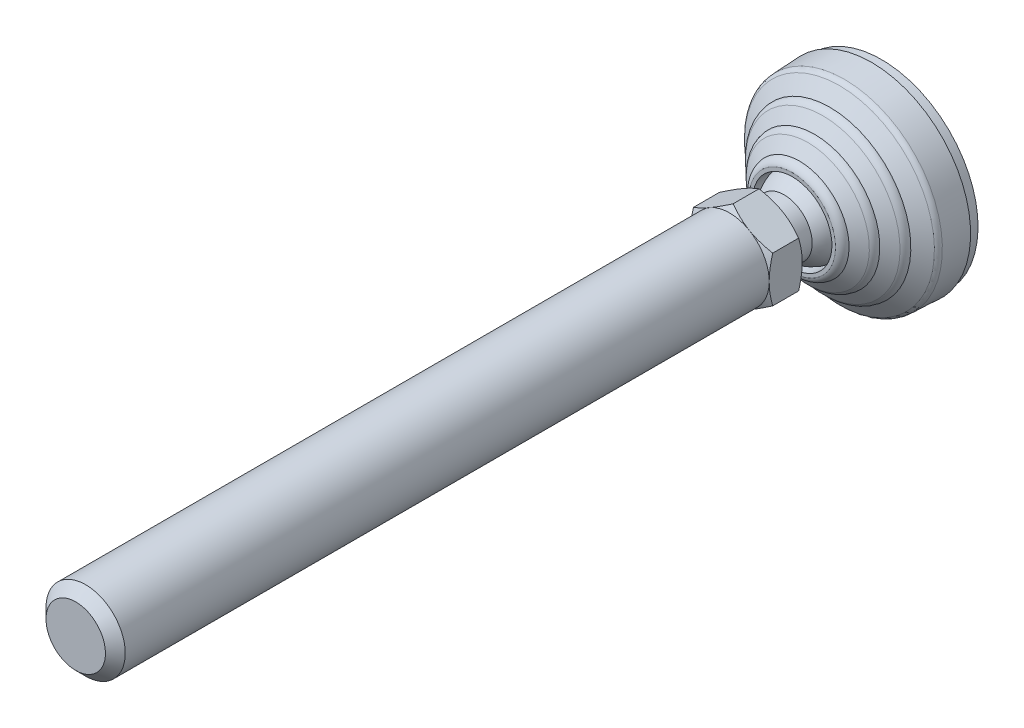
ISO-10303-21;
HEADER;
FILE_DESCRIPTION(('STEP AP214'),'2;1');
FILE_NAME('part.step','',(''),(''),'','','');
FILE_SCHEMA(('AUTOMOTIVE_DESIGN { 1 0 10303 214 1 1 1 1 }'));
ENDSEC;
DATA;
#1=APPLICATION_CONTEXT('core data for automotive mechanical design processes');
#2=APPLICATION_PROTOCOL_DEFINITION('international standard','automotive_design',2000,#1);
#3=PRODUCT_CONTEXT('',#1,'mechanical');
#4=PRODUCT('Part','Part','',(#3));
#5=PRODUCT_RELATED_PRODUCT_CATEGORY('part','',(#4));
#6=PRODUCT_DEFINITION_FORMATION('','',#4);
#7=PRODUCT_DEFINITION_CONTEXT('part definition',#1,'design');
#8=PRODUCT_DEFINITION('design','',#6,#7);
#9=PRODUCT_DEFINITION_SHAPE('','',#8);
#10=(LENGTH_UNIT() NAMED_UNIT(*) SI_UNIT(.MILLI.,.METRE.));
#11=(NAMED_UNIT(*) PLANE_ANGLE_UNIT() SI_UNIT($,.RADIAN.));
#12=(NAMED_UNIT(*) SI_UNIT($,.STERADIAN.) SOLID_ANGLE_UNIT());
#13=UNCERTAINTY_MEASURE_WITH_UNIT(LENGTH_MEASURE(1.E-05),#10,'distance_accuracy_value','');
#14=(GEOMETRIC_REPRESENTATION_CONTEXT(3) GLOBAL_UNCERTAINTY_ASSIGNED_CONTEXT((#13)) GLOBAL_UNIT_ASSIGNED_CONTEXT((#10,
#11,#12)) REPRESENTATION_CONTEXT('',''));
#15=CARTESIAN_POINT('',(0.,0.,0.));
#16=DIRECTION('',(0.,0.,1.));
#17=DIRECTION('',(1.,0.,0.));
#18=AXIS2_PLACEMENT_3D('',#15,#16,#17);
#19=CARTESIAN_POINT('',(0.,0.,93.1595));
#20=DIRECTION('',(0.,0.,-1.));
#21=DIRECTION('',(0.,1.,0.));
#22=AXIS2_PLACEMENT_3D('',#19,#20,#21);
#23=CYLINDRICAL_SURFACE('',#22,12.);
#24=CARTESIAN_POINT('',(0.,0.,241.));
#25=DIRECTION('',(0.,0.,1.));
#26=DIRECTION('',(0.,-1.,0.));
#27=AXIS2_PLACEMENT_3D('',#24,#25,#26);
#28=CIRCLE('',#27,12.);
#29=CARTESIAN_POINT('',(0.,-12.,241.));
#30=VERTEX_POINT('',#29);
#31=EDGE_CURVE('E9',#30,#30,#28,.F.);
#32=ORIENTED_EDGE('',*,*,#31,.T.);
#33=EDGE_LOOP('',(#32));
#34=FACE_BOUND('',#33,.T.);
#35=CARTESIAN_POINT('',(0.,0.,46.));
#36=DIRECTION('',(0.,0.,-1.));
#37=DIRECTION('',(0.,1.,0.));
#38=AXIS2_PLACEMENT_3D('',#35,#36,#37);
#39=CIRCLE('',#38,12.);
#40=CARTESIAN_POINT('',(0.,12.,46.));
#41=VERTEX_POINT('',#40);
#42=EDGE_CURVE('E124',#41,#41,#39,.F.);
#43=ORIENTED_EDGE('',*,*,#42,.T.);
#44=EDGE_LOOP('',(#43));
#45=FACE_BOUND('',#44,.T.);
#46=ADVANCED_FACE('F14',(#34,#45),#23,.T.);
#47=CARTESIAN_POINT('',(11.995,0.,46.));
#48=DIRECTION('',(0.,0.,-1.));
#49=DIRECTION('',(0.,1.,0.));
#50=AXIS2_PLACEMENT_3D('',#47,#48,#49);
#51=PLANE('',#50);
#52=CARTESIAN_POINT('',(0.,0.,46.));
#53=DIRECTION('',(0.,0.,-1.));
#54=DIRECTION('',(0.,1.,0.));
#55=AXIS2_PLACEMENT_3D('',#52,#53,#54);
#56=CIRCLE('',#55,11.99);
#57=CARTESIAN_POINT('',(0.,11.99,46.));
#58=VERTEX_POINT('',#57);
#59=EDGE_CURVE('E132',#58,#58,#56,.F.);
#60=ORIENTED_EDGE('',*,*,#59,.T.);
#61=EDGE_LOOP('',(#60));
#62=FACE_BOUND('',#61,.T.);
#63=ORIENTED_EDGE('',*,*,#42,.F.);
#64=EDGE_LOOP('',(#63));
#65=FACE_BOUND('',#64,.T.);
#66=ADVANCED_FACE('F157',(#62,#65),#51,.T.);
#67=CARTESIAN_POINT('',(0.,0.,44.9159643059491));
#68=DIRECTION('',(0.,0.,-1.));
#69=DIRECTION('',(0.,1.,0.));
#70=AXIS2_PLACEMENT_3D('',#67,#68,#69);
#71=CONICAL_SURFACE('',#70,13.8676048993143,1.0471975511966);
#72=ORIENTED_EDGE('',*,*,#59,.F.);
#73=EDGE_LOOP('',(#72));
#74=FACE_BOUND('',#73,.T.);
#75=CARTESIAN_POINT('',(-2.88482840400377E-08,-13.8564064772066,44.9224297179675));
#76=CARTESIAN_POINT('',(0.263784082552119,-13.7041106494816,45.010340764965));
#77=CARTESIAN_POINT('',(0.528551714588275,-13.5512469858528,45.0942615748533));
#78=CARTESIAN_POINT('',(1.06021019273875,-13.2442938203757,45.2530155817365));
#79=CARTESIAN_POINT('',(1.32710170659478,-13.0902039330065,45.3278457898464));
#80=CARTESIAN_POINT('',(2.13207647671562,-12.6254515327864,45.537252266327));
#81=CARTESIAN_POINT('',(2.67333741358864,-12.3129543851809,45.6563603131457));
#82=CARTESIAN_POINT('',(3.48330954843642,-11.8453167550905,45.796023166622));
#83=CARTESIAN_POINT('',(3.74960108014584,-11.6915732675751,45.8358073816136));
#84=CARTESIAN_POINT('',(4.28341699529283,-11.3833745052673,45.9025217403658));
#85=CARTESIAN_POINT('',(4.55094140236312,-11.2289192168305,45.9294516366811));
#86=CARTESIAN_POINT('',(5.08643614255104,-10.9197511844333,45.9697675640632));
#87=CARTESIAN_POINT('',(5.35440556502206,-10.7650389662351,45.9831696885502));
#88=CARTESIAN_POINT('',(5.8905925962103,-10.4554712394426,45.996144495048));
#89=CARTESIAN_POINT('',(6.15881019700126,-10.3006157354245,45.9957176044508));
#90=CARTESIAN_POINT('',(6.66023029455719,-10.0111207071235,45.9820002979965));
#91=CARTESIAN_POINT('',(6.89346857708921,-9.87646052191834,45.97038309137));
#92=CARTESIAN_POINT('',(7.35940867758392,-9.60744987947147,45.9369099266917));
#93=CARTESIAN_POINT('',(7.59211045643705,-9.47309944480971,45.9150532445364));
#94=CARTESIAN_POINT('',(8.05685109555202,-9.20478131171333,45.8614821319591));
#95=CARTESIAN_POINT('',(8.28888924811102,-9.07081402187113,45.8297595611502));
#96=CARTESIAN_POINT('',(8.75187776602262,-8.80350747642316,45.7570131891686));
#97=CARTESIAN_POINT('',(8.98282805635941,-8.67016826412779,45.7159887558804));
#98=CARTESIAN_POINT('',(9.68388987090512,-8.26541003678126,45.5779256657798));
#99=CARTESIAN_POINT('',(10.1519713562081,-7.99516306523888,45.4671213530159));
#100=CARTESIAN_POINT('',(11.081155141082,-7.45869855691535,45.2156417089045));
#101=CARTESIAN_POINT('',(11.5422693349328,-7.19247415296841,45.075025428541));
#102=CARTESIAN_POINT('',(11.9999999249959,-6.92820327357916,44.922429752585));
#103=B_SPLINE_CURVE_WITH_KNOTS('',3,(#75,#76,#77,#78,#79,#80,#81,#82,#83,#84,#85,#86,#87,#88,
#89,#90,#91,#92,#93,#94,#95,#96,#97,#98,#99,#100,#101,#102),.UNSPECIFIED.,.F.,.F.,(4,2,2,2,2,2,
2,2,2,2,2,2,2,4),(0.,0.950996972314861,1.90230578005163,3.80897261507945,4.73890631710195,
5.6688579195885,6.59770188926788,7.52651715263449,8.33503482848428,9.14360968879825,
9.95285348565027,10.7621522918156,12.4163368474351,14.0672749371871),.UNSPECIFIED.);
#104=CARTESIAN_POINT('',(-1.44241383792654E-08,-13.8564064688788,44.9224297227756));
#105=VERTEX_POINT('',#104);
#106=CARTESIAN_POINT('',(12.,-6.92820324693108,44.9224297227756));
#107=VERTEX_POINT('',#106);
#108=EDGE_CURVE('E143',#105,#107,#103,.T.);
#109=ORIENTED_EDGE('',*,*,#108,.T.);
#110=CARTESIAN_POINT('',(12.,-6.92820326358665,44.9224297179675));
#111=CARTESIAN_POINT('',(12.,-6.64374493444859,45.0045333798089));
#112=CARTESIAN_POINT('',(12.,-6.35829458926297,45.0831531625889));
#113=CARTESIAN_POINT('',(12.,-5.78524260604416,45.2325348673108));
#114=CARTESIAN_POINT('',(12.,-5.49764024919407,45.3032940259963));
#115=CARTESIAN_POINT('',(12.,-4.63053083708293,45.5026195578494));
#116=CARTESIAN_POINT('',(12.,-4.04782834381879,45.6179071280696));
#117=CARTESIAN_POINT('',(12.,-3.17548925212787,45.7575170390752));
#118=CARTESIAN_POINT('',(12.,-2.88840964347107,45.7982045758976));
#119=CARTESIAN_POINT('',(12.,-2.31290718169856,45.8685767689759));
#120=CARTESIAN_POINT('',(12.,-2.02448443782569,45.8982623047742));
#121=CARTESIAN_POINT('',(12.,-1.44696804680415,45.9459902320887));
#122=CARTESIAN_POINT('',(12.,-1.15787537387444,45.9640443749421));
#123=CARTESIAN_POINT('',(12.,-0.579188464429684,45.9881624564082));
#124=CARTESIAN_POINT('',(12.,-0.289594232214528,45.994226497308));
#125=CARTESIAN_POINT('',(12.,0.289594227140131,45.9942264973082));
#126=CARTESIAN_POINT('',(12.,0.579188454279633,45.9881624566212));
#127=CARTESIAN_POINT('',(12.,1.15787535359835,45.9640443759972));
#128=CARTESIAN_POINT('',(12.,1.44696802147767,45.9459902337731));
#129=CARTESIAN_POINT('',(12.,2.02448440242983,45.8982623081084));
#130=CARTESIAN_POINT('',(12.,2.31290714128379,45.8685767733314));
#131=CARTESIAN_POINT('',(12.,2.88840959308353,45.798204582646));
#132=CARTESIAN_POINT('',(12.,3.17548919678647,45.7575170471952));
#133=CARTESIAN_POINT('',(12.,4.04782827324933,45.6179071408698));
#134=CARTESIAN_POINT('',(12.,4.63053075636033,45.5026195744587));
#135=CARTESIAN_POINT('',(12.,5.49764015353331,45.3032940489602));
#136=CARTESIAN_POINT('',(12.,5.78524250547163,45.2325348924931));
#137=CARTESIAN_POINT('',(12.,6.35829447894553,45.0831531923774));
#138=CARTESIAN_POINT('',(12.,6.64374481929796,45.004533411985));
#139=CARTESIAN_POINT('',(12.,6.92820314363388,44.9224297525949));
#140=B_SPLINE_CURVE_WITH_KNOTS('',3,(#110,#111,#112,#113,#114,#115,#116,#117,#118,#119,#120,
#121,#122,#123,#124,#125,#126,#127,#128,#129,#130,#131,#132,#133,#134,#135,#136,#137,#138,#139),
.UNSPECIFIED.,.F.,.F.,(4,2,2,2,2,2,2,2,2,2,2,2,2,2,4),(0.,0.888148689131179,1.77660860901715,
3.55698615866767,4.42666281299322,5.2962699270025,6.16499708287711,7.03371682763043,
7.90243655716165,8.7711636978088,9.64077079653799,10.5104474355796,12.2908249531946,
13.1792848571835,14.0674335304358),.UNSPECIFIED.);
#141=CARTESIAN_POINT('',(12.0000000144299,6.92820322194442,44.9224297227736));
#142=VERTEX_POINT('',#141);
#143=EDGE_CURVE('E135',#107,#142,#140,.T.);
#144=ORIENTED_EDGE('',*,*,#143,.T.);
#145=CARTESIAN_POINT('',(12.0000000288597,6.92820321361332,44.9224297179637));
#146=CARTESIAN_POINT('',(11.7362159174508,7.08049904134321,45.0103407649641));
#147=CARTESIAN_POINT('',(11.4714482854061,7.23336270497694,45.0942615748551));
#148=CARTESIAN_POINT('',(10.9397898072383,7.54031587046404,45.2530155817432));
#149=CARTESIAN_POINT('',(10.6728982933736,7.69440575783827,45.3278457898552));
#150=CARTESIAN_POINT('',(9.86792352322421,8.15915815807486,45.5372522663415));
#151=CARTESIAN_POINT('',(9.32666258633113,8.47165530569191,45.6563603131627));
#152=CARTESIAN_POINT('',(8.51669045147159,8.93929293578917,45.7960231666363));
#153=CARTESIAN_POINT('',(8.25039891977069,9.0930364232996,45.8358073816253));
#154=CARTESIAN_POINT('',(7.71658300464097,9.40123518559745,45.9025217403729));
#155=CARTESIAN_POINT('',(7.44905859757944,9.55569047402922,45.9294516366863));
#156=CARTESIAN_POINT('',(6.91356385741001,9.86485850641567,45.9697675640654));
#157=CARTESIAN_POINT('',(6.64559443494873,10.0195707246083,45.9831696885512));
#158=CARTESIAN_POINT('',(6.10940740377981,10.3291384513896,45.996144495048));
#159=CARTESIAN_POINT('',(5.84118980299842,10.4839939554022,45.9957176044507));
#160=CARTESIAN_POINT('',(5.33976970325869,10.773488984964,45.9820002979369));
#161=CARTESIAN_POINT('',(5.10653141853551,10.9081491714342,45.970383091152));
#162=CARTESIAN_POINT('',(4.64059131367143,11.1771598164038,45.9369099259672));
#163=CARTESIAN_POINT('',(4.4078895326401,11.3115102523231,45.9150532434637));
#164=CARTESIAN_POINT('',(3.94314888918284,11.5798283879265,45.8614821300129));
#165=CARTESIAN_POINT('',(3.71111073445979,11.7137956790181,45.8297595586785));
#166=CARTESIAN_POINT('',(3.24812221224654,11.9811022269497,45.7570131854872));
#167=CARTESIAN_POINT('',(3.01717191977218,12.1144414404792,45.7159887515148));
#168=CARTESIAN_POINT('',(2.31611009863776,12.5191996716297,45.5779256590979));
#169=CARTESIAN_POINT('',(1.84802860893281,12.7894466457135,45.4671213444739));
#170=CARTESIAN_POINT('',(0.918844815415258,13.3259111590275,45.2156416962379));
#171=CARTESIAN_POINT('',(0.457730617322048,13.5921355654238,45.0750254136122));
#172=CARTESIAN_POINT('',(2.30778996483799E-08,13.856406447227,44.9224297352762));
#173=B_SPLINE_CURVE_WITH_KNOTS('',3,(#145,#146,#147,#148,#149,#150,#151,#152,#153,#154,#155,
#156,#157,#158,#159,#160,#161,#162,#163,#164,#165,#166,#167,#168,#169,#170,#171,#172),
.UNSPECIFIED.,.F.,.F.,(4,2,2,2,2,2,2,2,2,2,2,2,2,4),(0.,0.95099697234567,1.9023057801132,
3.8089726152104,4.73890631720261,5.66885791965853,6.59770188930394,7.52651715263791,
8.33503483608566,9.14360970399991,9.95285350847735,10.7621523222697,12.4163368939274,
14.0672749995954),.UNSPECIFIED.);
#174=CARTESIAN_POINT('',(-1.15389586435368E-08,13.856406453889,44.92242973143));
#175=VERTEX_POINT('',#174);
#176=EDGE_CURVE('E180',#142,#175,#173,.T.);
#177=ORIENTED_EDGE('',*,*,#176,.T.);
#178=CARTESIAN_POINT('',(-2.30779106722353E-08,13.856406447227,44.9224297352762));
#179=CARTESIAN_POINT('',(-0.263784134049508,13.7041106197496,45.0103407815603));
#180=CARTESIAN_POINT('',(-0.528551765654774,13.5512469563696,45.0942615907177));
#181=CARTESIAN_POINT('',(-1.06021024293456,13.2442937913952,45.2530155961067));
#182=CARTESIAN_POINT('',(-1.32710175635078,13.0902039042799,45.3278458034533));
#183=CARTESIAN_POINT('',(-2.13207652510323,12.6254515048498,45.5372522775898));
#184=CARTESIAN_POINT('',(-2.67333746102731,12.3129543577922,45.656360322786));
#185=CARTESIAN_POINT('',(-3.48330959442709,11.8453167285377,45.7960231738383));
#186=CARTESIAN_POINT('',(-3.74960112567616,11.6915732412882,45.8358073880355));
#187=CARTESIAN_POINT('',(-4.28341703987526,11.3833744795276,45.9025217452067));
#188=CARTESIAN_POINT('',(-4.55094144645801,11.2289191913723,45.9294516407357));
#189=CARTESIAN_POINT('',(-5.08643618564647,10.9197511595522,45.9697675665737));
#190=CARTESIAN_POINT('',(-5.35440560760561,10.7650389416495,45.9831696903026));
#191=CARTESIAN_POINT('',(-5.89059263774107,10.4554712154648,45.9961444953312));
#192=CARTESIAN_POINT('',(-6.15881023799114,10.300615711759,45.9957176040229));
#193=CARTESIAN_POINT('',(-6.66023033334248,10.0111206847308,45.9820002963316));
#194=CARTESIAN_POINT('',(-6.89346861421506,9.87646050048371,45.9703830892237));
#195=CARTESIAN_POINT('',(-7.35940871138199,9.60744985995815,45.9369099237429));
#196=CARTESIAN_POINT('',(-7.59211048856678,9.4730994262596,45.9150532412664));
#197=CARTESIAN_POINT('',(-8.05685112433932,9.20478129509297,45.8614821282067));
#198=CARTESIAN_POINT('',(-8.28888927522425,9.0708140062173,45.8297595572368));
#199=CARTESIAN_POINT('',(-8.75187778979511,8.8035074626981,45.7570131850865));
#200=CARTESIAN_POINT('',(-8.98282807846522,8.67016825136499,45.7159887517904));
#201=CARTESIAN_POINT('',(-9.68388988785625,8.26541002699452,45.5779256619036));
#202=CARTESIAN_POINT('',(-10.1519713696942,7.9951630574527,45.4671213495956));
#203=CARTESIAN_POINT('',(-11.0811551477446,7.45869855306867,45.2156417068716));
#204=CARTESIAN_POINT('',(-11.5422693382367,7.19247415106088,45.0750254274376));
#205=CARTESIAN_POINT('',(-11.9999999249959,6.92820327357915,44.922429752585));
#206=B_SPLINE_CURVE_WITH_KNOTS('',3,(#178,#179,#180,#181,#182,#183,#184,#185,#186,#187,#188,
#189,#190,#191,#192,#193,#194,#195,#196,#197,#198,#199,#200,#201,#202,#203,#204,#205),
.UNSPECIFIED.,.F.,.F.,(4,2,2,2,2,2,2,2,2,2,2,2,2,4),(0.,0.9509969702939,1.90230577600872,
3.80897260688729,4.73890630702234,5.6688579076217,6.5977018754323,7.52651713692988,
8.33503480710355,9.14360966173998,9.95285345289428,10.7621522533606,12.4163367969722,
14.067274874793),.UNSPECIFIED.);
#207=CARTESIAN_POINT('',(-12.,6.92820324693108,44.9224297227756));
#208=VERTEX_POINT('',#207);
#209=EDGE_CURVE('E172',#175,#208,#206,.T.);
#210=ORIENTED_EDGE('',*,*,#209,.T.);
#211=CARTESIAN_POINT('',(-12.,6.92820326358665,44.9224297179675));
#212=CARTESIAN_POINT('',(-12.,6.64374493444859,45.0045333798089));
#213=CARTESIAN_POINT('',(-12.,6.35829458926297,45.0831531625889));
#214=CARTESIAN_POINT('',(-12.,5.78524260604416,45.2325348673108));
#215=CARTESIAN_POINT('',(-12.,5.49764024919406,45.3032940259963));
#216=CARTESIAN_POINT('',(-12.,4.63053083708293,45.5026195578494));
#217=CARTESIAN_POINT('',(-12.,4.04782834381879,45.6179071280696));
#218=CARTESIAN_POINT('',(-12.,3.17548925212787,45.7575170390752));
#219=CARTESIAN_POINT('',(-12.,2.88840964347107,45.7982045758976));
#220=CARTESIAN_POINT('',(-12.,2.31290718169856,45.8685767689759));
#221=CARTESIAN_POINT('',(-12.,2.02448443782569,45.8982623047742));
#222=CARTESIAN_POINT('',(-12.,1.44696804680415,45.9459902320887));
#223=CARTESIAN_POINT('',(-12.,1.15787537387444,45.9640443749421));
#224=CARTESIAN_POINT('',(-12.,0.579188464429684,45.9881624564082));
#225=CARTESIAN_POINT('',(-12.,0.289594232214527,45.994226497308));
#226=CARTESIAN_POINT('',(-12.,-0.289594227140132,45.9942264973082));
#227=CARTESIAN_POINT('',(-12.,-0.579188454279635,45.9881624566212));
#228=CARTESIAN_POINT('',(-12.,-1.15787535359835,45.9640443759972));
#229=CARTESIAN_POINT('',(-12.,-1.44696802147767,45.9459902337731));
#230=CARTESIAN_POINT('',(-12.,-2.02448440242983,45.8982623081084));
#231=CARTESIAN_POINT('',(-12.,-2.31290714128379,45.8685767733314));
#232=CARTESIAN_POINT('',(-12.,-2.88840959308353,45.798204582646));
#233=CARTESIAN_POINT('',(-12.,-3.17548919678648,45.7575170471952));
#234=CARTESIAN_POINT('',(-12.,-4.04782827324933,45.6179071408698));
#235=CARTESIAN_POINT('',(-12.,-4.63053075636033,45.5026195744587));
#236=CARTESIAN_POINT('',(-12.,-5.49764015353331,45.3032940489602));
#237=CARTESIAN_POINT('',(-12.,-5.78524250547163,45.2325348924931));
#238=CARTESIAN_POINT('',(-12.,-6.35829447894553,45.0831531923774));
#239=CARTESIAN_POINT('',(-12.,-6.64374481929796,45.004533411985));
#240=CARTESIAN_POINT('',(-12.,-6.92820314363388,44.9224297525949));
#241=B_SPLINE_CURVE_WITH_KNOTS('',3,(#211,#212,#213,#214,#215,#216,#217,#218,#219,#220,#221,
#222,#223,#224,#225,#226,#227,#228,#229,#230,#231,#232,#233,#234,#235,#236,#237,#238,#239,#240),
.UNSPECIFIED.,.F.,.F.,(4,2,2,2,2,2,2,2,2,2,2,2,2,2,4),(0.,0.888148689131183,1.77660860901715,
3.55698615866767,4.42666281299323,5.2962699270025,6.16499708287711,7.03371682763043,
7.90243655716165,8.7711636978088,9.64077079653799,10.5104474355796,12.2908249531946,
13.1792848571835,14.0674335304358),.UNSPECIFIED.);
#242=CARTESIAN_POINT('',(-12.0000000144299,-6.92820322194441,44.9224297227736));
#243=VERTEX_POINT('',#242);
#244=EDGE_CURVE('E350',#208,#243,#241,.T.);
#245=ORIENTED_EDGE('',*,*,#244,.T.);
#246=CARTESIAN_POINT('',(-12.0000000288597,-6.92820321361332,44.9224297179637));
#247=CARTESIAN_POINT('',(-11.7362159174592,-7.08049904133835,45.0103407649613));
#248=CARTESIAN_POINT('',(-11.471448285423,-7.23336270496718,45.0942615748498));
#249=CARTESIAN_POINT('',(-10.9397898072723,-7.54031587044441,45.2530155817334));
#250=CARTESIAN_POINT('',(-10.6728982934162,-7.69440575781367,45.3278457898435));
#251=CARTESIAN_POINT('',(-9.86792352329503,-8.15915815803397,45.5372522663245));
#252=CARTESIAN_POINT('',(-9.32666258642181,-8.47165530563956,45.6563603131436));
#253=CARTESIAN_POINT('',(-8.51669045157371,-8.93929293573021,45.7960231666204));
#254=CARTESIAN_POINT('',(-8.25039891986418,-9.09303642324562,45.8358073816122));
#255=CARTESIAN_POINT('',(-7.71658300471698,-9.40123518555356,45.9025217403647));
#256=CARTESIAN_POINT('',(-7.44905859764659,-9.55569047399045,45.9294516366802));
#257=CARTESIAN_POINT('',(-6.91356385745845,-9.8648585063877,45.9697675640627));
#258=CARTESIAN_POINT('',(-6.64559443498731,-10.019570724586,45.9831696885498));
#259=CARTESIAN_POINT('',(-6.10940740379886,-10.3291384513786,45.996144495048));
#260=CARTESIAN_POINT('',(-5.84118980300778,-10.4839939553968,45.9957176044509));
#261=CARTESIAN_POINT('',(-5.33976970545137,-10.7734889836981,45.9820002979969));
#262=CARTESIAN_POINT('',(-5.10653142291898,-10.9081491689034,45.9703830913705));
#263=CARTESIAN_POINT('',(-4.64059132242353,-11.1771598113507,45.9369099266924));
#264=CARTESIAN_POINT('',(-4.40788954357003,-11.3115102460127,45.9150532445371));
#265=CARTESIAN_POINT('',(-3.94314890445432,-11.5798283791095,45.8614821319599));
#266=CARTESIAN_POINT('',(-3.71111075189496,-11.7137956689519,45.8297595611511));
#267=CARTESIAN_POINT('',(-3.24812223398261,-11.9811022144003,45.7570131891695));
#268=CARTESIAN_POINT('',(-3.01717194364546,-12.1144414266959,45.7159887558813));
#269=CARTESIAN_POINT('',(-2.3161101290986,-12.5191996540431,45.5779256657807));
#270=CARTESIAN_POINT('',(-1.84802864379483,-12.7894466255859,45.4671213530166));
#271=CARTESIAN_POINT('',(-0.918844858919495,-13.3259111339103,45.215641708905));
#272=CARTESIAN_POINT('',(-0.457730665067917,-13.5921355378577,45.0750254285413));
#273=CARTESIAN_POINT('',(-7.50040968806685E-08,-13.8564064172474,44.922429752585));
#274=B_SPLINE_CURVE_WITH_KNOTS('',3,(#246,#247,#248,#249,#250,#251,#252,#253,#254,#255,#256,
#257,#258,#259,#260,#261,#262,#263,#264,#265,#266,#267,#268,#269,#270,#271,#272,#273),
.UNSPECIFIED.,.F.,.F.,(4,2,2,2,2,2,2,2,2,2,2,2,2,4),(0.,0.950996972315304,1.90230578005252,
3.80897261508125,4.73890631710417,5.66885791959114,6.59770188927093,7.52651715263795,
8.33503482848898,9.14360968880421,9.95285348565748,10.7621522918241,12.4163368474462,
14.0672749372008),.UNSPECIFIED.);
#275=EDGE_CURVE('E162',#243,#105,#274,.T.);
#276=ORIENTED_EDGE('',*,*,#275,.T.);
#277=EDGE_LOOP('',(#109,#144,#177,#210,#245,#276));
#278=FACE_BOUND('',#277,.T.);
#279=ADVANCED_FACE('F152',(#74,#278),#71,.T.);
#280=CARTESIAN_POINT('',(0.,-13.856406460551,46.1));
#281=DIRECTION('',(0.5,0.866025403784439,0.));
#282=DIRECTION('',(-0.866025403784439,0.5,0.));
#283=AXIS2_PLACEMENT_3D('',#280,#281,#282);
#284=PLANE('',#283);
#285=DIRECTION('',(0.,0.,1.));
#286=VECTOR('',#285,1.);
#287=CARTESIAN_POINT('',(0.,-13.856406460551,46.1));
#288=LINE('',#287,#286);
#289=CARTESIAN_POINT('',(0.,-13.856406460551,37.0775702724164));
#290=VERTEX_POINT('',#289);
#291=EDGE_CURVE('E376',#290,#105,#288,.T.);
#292=ORIENTED_EDGE('',*,*,#291,.T.);
#293=ORIENTED_EDGE('',*,*,#275,.F.);
#294=DIRECTION('',(0.,0.,1.));
#295=VECTOR('',#294,1.);
#296=CARTESIAN_POINT('',(-12.,-6.9282032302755,46.1));
#297=LINE('',#296,#295);
#298=CARTESIAN_POINT('',(-12.,-6.9282032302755,37.0775702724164));
#299=VERTEX_POINT('',#298);
#300=EDGE_CURVE('E368',#299,#243,#297,.T.);
#301=ORIENTED_EDGE('',*,*,#300,.F.);
#302=CARTESIAN_POINT('',(0.,-13.856406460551,37.0775702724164));
#303=CARTESIAN_POINT('',(-0.263784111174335,-13.7041106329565,36.9896592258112));
#304=CARTESIAN_POINT('',(-0.528551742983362,-13.5512469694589,36.9057384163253));
#305=CARTESIAN_POINT('',(-1.0602102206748,-13.2442938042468,36.7469844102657));
#306=CARTESIAN_POINT('',(-1.32710173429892,-13.0902039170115,36.6721542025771));
#307=CARTESIAN_POINT('',(-2.13207650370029,-12.6254515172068,36.4627477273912));
#308=CARTESIAN_POINT('',(-2.67333744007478,-12.3129543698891,36.3436396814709));
#309=CARTESIAN_POINT('',(-3.48330957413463,-11.8453167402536,36.2039768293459));
#310=CARTESIAN_POINT('',(-3.74960110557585,-11.6915732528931,36.1641926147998));
#311=CARTESIAN_POINT('',(-4.28341702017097,-11.3833744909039,36.097478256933));
#312=CARTESIAN_POINT('',(-4.55094142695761,-11.2289192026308,36.0705483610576));
#313=CARTESIAN_POINT('',(-5.08643616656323,-10.9197511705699,36.0302324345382));
#314=CARTESIAN_POINT('',(-5.35440558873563,-10.765038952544,36.0168303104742));
#315=CARTESIAN_POINT('',(-5.89059261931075,-10.4554712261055,36.0038555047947));
#316=CARTESIAN_POINT('',(-6.15881021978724,-10.300615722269,36.0042823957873));
#317=CARTESIAN_POINT('',(-6.66023031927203,-10.0111206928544,36.0179997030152));
#318=CARTESIAN_POINT('',(-6.8934686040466,-9.87646050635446,36.029616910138));
#319=CARTESIAN_POINT('',(-7.35940870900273,-9.6074498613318,36.063090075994));
#320=CARTESIAN_POINT('',(-7.59211049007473,-9.47309942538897,36.0849467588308));
#321=CARTESIAN_POINT('',(-8.05685113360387,-9.20478128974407,36.1385178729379));
#322=CARTESIAN_POINT('',(-8.28888928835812,-9.07081399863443,36.1702404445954));
#323=CARTESIAN_POINT('',(-8.75187781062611,-8.8035074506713,36.2429868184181));
#324=CARTESIAN_POINT('',(-8.98282810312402,-8.67016823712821,36.2840112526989));
#325=CARTESIAN_POINT('',(-9.6838899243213,-8.2654100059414,36.4220743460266));
#326=CARTESIAN_POINT('',(-10.1519714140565,-7.99516303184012,36.5328786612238));
#327=CARTESIAN_POINT('',(-11.0811552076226,-7.45869851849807,36.7843583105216));
#328=CARTESIAN_POINT('',(-11.5422694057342,-7.19247411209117,36.924974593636));
#329=CARTESIAN_POINT('',(-12.,-6.9282032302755,37.0775702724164));
#330=B_SPLINE_CURVE_WITH_KNOTS('',3,(#302,#303,#304,#305,#306,#307,#308,#309,#310,#311,#312,
#313,#314,#315,#316,#317,#318,#319,#320,#321,#322,#323,#324,#325,#326,#327,#328,#329),
.UNSPECIFIED.,.F.,.F.,(4,2,2,2,2,2,2,2,2,2,2,2,2,4),(0.,0.950996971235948,1.90230577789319,
3.80897261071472,4.73890631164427,5.66885791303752,6.59770188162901,7.52651714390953,
8.33503482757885,9.14360969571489,9.9528535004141,10.7621523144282,12.4163368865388,
14.0672749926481),.UNSPECIFIED.);
#331=EDGE_CURVE('E370',#290,#299,#330,.T.);
#332=ORIENTED_EDGE('',*,*,#331,.F.);
#333=EDGE_LOOP('',(#292,#293,#301,#332));
#334=FACE_BOUND('',#333,.T.);
#335=ADVANCED_FACE('F156',(#334),#284,.F.);
#336=CARTESIAN_POINT('',(12.,-6.92820323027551,46.1));
#337=DIRECTION('',(-0.5,0.866025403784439,0.));
#338=DIRECTION('',(-0.866025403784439,-0.5,0.));
#339=AXIS2_PLACEMENT_3D('',#336,#337,#338);
#340=PLANE('',#339);
#341=DIRECTION('',(0.,0.,1.));
#342=VECTOR('',#341,1.);
#343=CARTESIAN_POINT('',(12.,-6.92820323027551,46.1));
#344=LINE('',#343,#342);
#345=CARTESIAN_POINT('',(12.,-6.92820323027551,37.0775702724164));
#346=VERTEX_POINT('',#345);
#347=EDGE_CURVE('E31',#346,#107,#344,.T.);
#348=ORIENTED_EDGE('',*,*,#347,.T.);
#349=ORIENTED_EDGE('',*,*,#108,.F.);
#350=ORIENTED_EDGE('',*,*,#291,.F.);
#351=CARTESIAN_POINT('',(12.,-6.92820323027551,37.0775702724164));
#352=CARTESIAN_POINT('',(11.7362158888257,-7.08049905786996,36.9896592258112));
#353=CARTESIAN_POINT('',(11.4714482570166,-7.2333627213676,36.9057384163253));
#354=CARTESIAN_POINT('',(10.9397897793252,-7.5403158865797,36.7469844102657));
#355=CARTESIAN_POINT('',(10.6728982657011,-7.69440577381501,36.6721542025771));
#356=CARTESIAN_POINT('',(9.86792349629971,-8.15915817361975,36.4627477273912));
#357=CARTESIAN_POINT('',(9.32666255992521,-8.4716553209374,36.3436396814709));
#358=CARTESIAN_POINT('',(8.51669042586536,-8.93929295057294,36.2039768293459));
#359=CARTESIAN_POINT('',(8.25039889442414,-9.09303643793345,36.1641926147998));
#360=CARTESIAN_POINT('',(7.71658297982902,-9.40123519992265,36.097478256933));
#361=CARTESIAN_POINT('',(7.44905857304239,-9.55569048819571,36.0705483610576));
#362=CARTESIAN_POINT('',(6.91356383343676,-9.86485852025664,36.0302324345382));
#363=CARTESIAN_POINT('',(6.64559441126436,-10.0195707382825,36.0168303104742));
#364=CARTESIAN_POINT('',(6.10940738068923,-10.329138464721,36.0038555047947));
#365=CARTESIAN_POINT('',(5.84118978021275,-10.4839939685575,36.0042823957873));
#366=CARTESIAN_POINT('',(5.33976968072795,-10.7734889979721,36.0179997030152));
#367=CARTESIAN_POINT('',(5.10653139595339,-10.9081491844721,36.029616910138));
#368=CARTESIAN_POINT('',(4.64059129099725,-11.1771598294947,36.063090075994));
#369=CARTESIAN_POINT('',(4.40788950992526,-11.3115102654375,36.0849467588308));
#370=CARTESIAN_POINT('',(3.94314886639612,-11.5798284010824,36.1385178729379));
#371=CARTESIAN_POINT('',(3.71111071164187,-11.7137956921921,36.1702404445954));
#372=CARTESIAN_POINT('',(3.24812218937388,-11.9811022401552,36.2429868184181));
#373=CARTESIAN_POINT('',(3.01717189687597,-12.1144414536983,36.2840112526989));
#374=CARTESIAN_POINT('',(2.3161100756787,-12.5191996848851,36.4220743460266));
#375=CARTESIAN_POINT('',(1.84802858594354,-12.7894466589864,36.5328786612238));
#376=CARTESIAN_POINT('',(0.918844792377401,-13.3259111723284,36.7843583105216));
#377=CARTESIAN_POINT('',(0.457730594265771,-13.5921355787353,36.924974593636));
#378=CARTESIAN_POINT('',(0.,-13.856406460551,37.0775702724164));
#379=B_SPLINE_CURVE_WITH_KNOTS('',3,(#351,#352,#353,#354,#355,#356,#357,#358,#359,#360,#361,
#362,#363,#364,#365,#366,#367,#368,#369,#370,#371,#372,#373,#374,#375,#376,#377,#378),
.UNSPECIFIED.,.F.,.F.,(4,2,2,2,2,2,2,2,2,2,2,2,2,4),(0.,0.95099697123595,1.90230577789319,
3.80897261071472,4.73890631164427,5.66885791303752,6.59770188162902,7.52651714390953,
8.33503482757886,9.14360969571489,9.9528535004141,10.7621523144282,12.4163368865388,
14.0672749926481),.UNSPECIFIED.);
#380=EDGE_CURVE('E377',#346,#290,#379,.T.);
#381=ORIENTED_EDGE('',*,*,#380,.F.);
#382=EDGE_LOOP('',(#348,#349,#350,#381));
#383=FACE_BOUND('',#382,.T.);
#384=ADVANCED_FACE('F383',(#383),#340,.F.);
#385=CARTESIAN_POINT('',(-12.,6.92820323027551,46.1));
#386=DIRECTION('',(0.5,-0.866025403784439,0.));
#387=DIRECTION('',(0.866025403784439,0.5,0.));
#388=AXIS2_PLACEMENT_3D('',#385,#386,#387);
#389=PLANE('',#388);
#390=DIRECTION('',(0.,0.,1.));
#391=VECTOR('',#390,1.);
#392=CARTESIAN_POINT('',(-12.,6.92820323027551,46.1));
#393=LINE('',#392,#391);
#394=CARTESIAN_POINT('',(-12.,6.92820323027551,37.0775702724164));
#395=VERTEX_POINT('',#394);
#396=EDGE_CURVE('E369',#395,#208,#393,.T.);
#397=ORIENTED_EDGE('',*,*,#396,.T.);
#398=ORIENTED_EDGE('',*,*,#209,.F.);
#399=DIRECTION('',(0.,0.,1.));
#400=VECTOR('',#399,1.);
#401=CARTESIAN_POINT('',(0.,13.856406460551,46.1));
#402=LINE('',#401,#400);
#403=CARTESIAN_POINT('',(0.,13.856406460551,37.0775702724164));
#404=VERTEX_POINT('',#403);
#405=EDGE_CURVE('E211',#404,#175,#402,.T.);
#406=ORIENTED_EDGE('',*,*,#405,.F.);
#407=CARTESIAN_POINT('',(-12.,6.92820323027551,37.0775702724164));
#408=CARTESIAN_POINT('',(-11.7362158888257,7.08049905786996,36.9896592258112));
#409=CARTESIAN_POINT('',(-11.4714482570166,7.2333627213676,36.9057384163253));
#410=CARTESIAN_POINT('',(-10.9397897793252,7.5403158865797,36.7469844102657));
#411=CARTESIAN_POINT('',(-10.6728982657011,7.69440577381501,36.6721542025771));
#412=CARTESIAN_POINT('',(-9.86792349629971,8.15915817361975,36.4627477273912));
#413=CARTESIAN_POINT('',(-9.32666255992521,8.4716553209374,36.3436396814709));
#414=CARTESIAN_POINT('',(-8.51669042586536,8.93929295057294,36.2039768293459));
#415=CARTESIAN_POINT('',(-8.25039889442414,9.09303643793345,36.1641926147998));
#416=CARTESIAN_POINT('',(-7.71658297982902,9.40123519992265,36.097478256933));
#417=CARTESIAN_POINT('',(-7.44905857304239,9.55569048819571,36.0705483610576));
#418=CARTESIAN_POINT('',(-6.91356383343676,9.86485852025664,36.0302324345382));
#419=CARTESIAN_POINT('',(-6.64559441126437,10.0195707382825,36.0168303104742));
#420=CARTESIAN_POINT('',(-6.10940738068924,10.329138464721,36.0038555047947));
#421=CARTESIAN_POINT('',(-5.84118978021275,10.4839939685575,36.0042823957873));
#422=CARTESIAN_POINT('',(-5.33976968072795,10.7734889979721,36.0179997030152));
#423=CARTESIAN_POINT('',(-5.10653139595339,10.9081491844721,36.029616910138));
#424=CARTESIAN_POINT('',(-4.64059129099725,11.1771598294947,36.063090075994));
#425=CARTESIAN_POINT('',(-4.40788950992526,11.3115102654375,36.0849467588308));
#426=CARTESIAN_POINT('',(-3.94314886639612,11.5798284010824,36.1385178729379));
#427=CARTESIAN_POINT('',(-3.71111071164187,11.7137956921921,36.1702404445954));
#428=CARTESIAN_POINT('',(-3.24812218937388,11.9811022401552,36.2429868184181));
#429=CARTESIAN_POINT('',(-3.01717189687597,12.1144414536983,36.2840112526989));
#430=CARTESIAN_POINT('',(-2.3161100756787,12.5191996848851,36.4220743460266));
#431=CARTESIAN_POINT('',(-1.84802858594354,12.7894466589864,36.5328786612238));
#432=CARTESIAN_POINT('',(-0.918844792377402,13.3259111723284,36.7843583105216));
#433=CARTESIAN_POINT('',(-0.457730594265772,13.5921355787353,36.924974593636));
#434=CARTESIAN_POINT('',(0.,13.856406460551,37.0775702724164));
#435=B_SPLINE_CURVE_WITH_KNOTS('',3,(#407,#408,#409,#410,#411,#412,#413,#414,#415,#416,#417,
#418,#419,#420,#421,#422,#423,#424,#425,#426,#427,#428,#429,#430,#431,#432,#433,#434),
.UNSPECIFIED.,.F.,.F.,(4,2,2,2,2,2,2,2,2,2,2,2,2,4),(0.,0.95099697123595,1.90230577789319,
3.80897261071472,4.73890631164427,5.66885791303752,6.59770188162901,7.52651714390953,
8.33503482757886,9.14360969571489,9.9528535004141,10.7621523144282,12.4163368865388,
14.0672749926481),.UNSPECIFIED.);
#436=EDGE_CURVE('E213',#395,#404,#435,.T.);
#437=ORIENTED_EDGE('',*,*,#436,.F.);
#438=EDGE_LOOP('',(#397,#398,#406,#437));
#439=FACE_BOUND('',#438,.T.);
#440=ADVANCED_FACE('F199',(#439),#389,.F.);
#441=CARTESIAN_POINT('',(-12.,-6.92820323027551,46.1));
#442=DIRECTION('',(1.,0.,0.));
#443=DIRECTION('',(0.,1.,0.));
#444=AXIS2_PLACEMENT_3D('',#441,#442,#443);
#445=PLANE('',#444);
#446=ORIENTED_EDGE('',*,*,#300,.T.);
#447=ORIENTED_EDGE('',*,*,#244,.F.);
#448=ORIENTED_EDGE('',*,*,#396,.F.);
#449=CARTESIAN_POINT('',(-12.,-6.9282032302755,37.0775702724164));
#450=CARTESIAN_POINT('',(-12.,-6.64374490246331,36.9954666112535));
#451=CARTESIAN_POINT('',(-12.,-6.35829455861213,36.9168468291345));
#452=CARTESIAN_POINT('',(-12.,-5.78524257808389,36.7674651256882));
#453=CARTESIAN_POINT('',(-12.,-5.49764022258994,36.6967059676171));
#454=CARTESIAN_POINT('',(-12.,-4.63053081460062,36.4973804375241));
#455=CARTESIAN_POINT('',(-12.,-4.04782832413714,36.3820928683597));
#456=CARTESIAN_POINT('',(-12.,-3.17548923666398,36.2424829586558));
#457=CARTESIAN_POINT('',(-12.,-2.88840962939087,36.2017954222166));
#458=CARTESIAN_POINT('',(-12.,-2.31290717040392,36.1314232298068));
#459=CARTESIAN_POINT('',(-12.,-2.02448442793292,36.1017376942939));
#460=CARTESIAN_POINT('',(-12.,-1.44696803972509,36.0540097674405));
#461=CARTESIAN_POINT('',(-12.,-1.1578753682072,36.035955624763));
#462=CARTESIAN_POINT('',(-12.,-0.579188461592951,36.0118375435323));
#463=CARTESIAN_POINT('',(-12.,-0.289594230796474,36.0057735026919));
#464=CARTESIAN_POINT('',(-12.,0.28959423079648,36.0057735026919));
#465=CARTESIAN_POINT('',(-12.,0.579188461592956,36.0118375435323));
#466=CARTESIAN_POINT('',(-12.,1.15787536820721,36.035955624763));
#467=CARTESIAN_POINT('',(-12.,1.4469680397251,36.0540097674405));
#468=CARTESIAN_POINT('',(-12.,2.02448442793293,36.1017376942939));
#469=CARTESIAN_POINT('',(-12.,2.31290717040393,36.1314232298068));
#470=CARTESIAN_POINT('',(-12.,2.88840962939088,36.2017954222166));
#471=CARTESIAN_POINT('',(-12.,3.17548923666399,36.2424829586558));
#472=CARTESIAN_POINT('',(-12.,4.04782832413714,36.3820928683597));
#473=CARTESIAN_POINT('',(-12.,4.63053081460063,36.4973804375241));
#474=CARTESIAN_POINT('',(-12.,5.49764022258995,36.6967059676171));
#475=CARTESIAN_POINT('',(-12.,5.7852425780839,36.7674651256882));
#476=CARTESIAN_POINT('',(-12.,6.35829455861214,36.9168468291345));
#477=CARTESIAN_POINT('',(-12.,6.64374490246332,36.9954666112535));
#478=CARTESIAN_POINT('',(-12.,6.92820323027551,37.0775702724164));
#479=B_SPLINE_CURVE_WITH_KNOTS('',3,(#449,#450,#451,#452,#453,#454,#455,#456,#457,#458,#459,
#460,#461,#462,#463,#464,#465,#466,#467,#468,#469,#470,#471,#472,#473,#474,#475,#476,#477,#478),
.UNSPECIFIED.,.F.,.F.,(4,2,2,2,2,2,2,2,2,2,2,2,2,2,4),(0.,0.888148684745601,1.77660860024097,
3.55698614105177,4.42666279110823,5.29626990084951,6.16499705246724,7.03371679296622,
7.90243653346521,8.77116368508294,9.64077079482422,10.5104474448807,12.2908249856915,
13.1792849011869,14.0674335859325),.UNSPECIFIED.);
#480=EDGE_CURVE('E362',#299,#395,#479,.T.);
#481=ORIENTED_EDGE('',*,*,#480,.F.);
#482=EDGE_LOOP('',(#446,#447,#448,#481));
#483=FACE_BOUND('',#482,.T.);
#484=ADVANCED_FACE('F356',(#483),#445,.F.);
#485=CARTESIAN_POINT('',(12.,6.92820323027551,46.1));
#486=DIRECTION('',(-1.,0.,0.));
#487=DIRECTION('',(0.,-1.,0.));
#488=AXIS2_PLACEMENT_3D('',#485,#486,#487);
#489=PLANE('',#488);
#490=DIRECTION('',(0.,0.,1.));
#491=VECTOR('',#490,1.);
#492=CARTESIAN_POINT('',(12.,6.92820323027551,46.1));
#493=LINE('',#492,#491);
#494=CARTESIAN_POINT('',(12.,6.9282032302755,37.0775702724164));
#495=VERTEX_POINT('',#494);
#496=EDGE_CURVE('E410',#142,#495,#493,.F.);
#497=ORIENTED_EDGE('',*,*,#496,.F.);
#498=ORIENTED_EDGE('',*,*,#143,.F.);
#499=ORIENTED_EDGE('',*,*,#347,.F.);
#500=CARTESIAN_POINT('',(12.,6.92820323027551,37.0775702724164));
#501=CARTESIAN_POINT('',(12.,6.64374490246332,36.9954666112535));
#502=CARTESIAN_POINT('',(12.,6.35829455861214,36.9168468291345));
#503=CARTESIAN_POINT('',(12.,5.7852425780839,36.7674651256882));
#504=CARTESIAN_POINT('',(12.,5.49764022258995,36.6967059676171));
#505=CARTESIAN_POINT('',(12.,4.63053081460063,36.4973804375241));
#506=CARTESIAN_POINT('',(12.,4.04782832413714,36.3820928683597));
#507=CARTESIAN_POINT('',(12.,3.17548923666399,36.2424829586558));
#508=CARTESIAN_POINT('',(12.,2.88840962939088,36.2017954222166));
#509=CARTESIAN_POINT('',(12.,2.31290717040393,36.1314232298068));
#510=CARTESIAN_POINT('',(12.,2.02448442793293,36.1017376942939));
#511=CARTESIAN_POINT('',(12.,1.4469680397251,36.0540097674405));
#512=CARTESIAN_POINT('',(12.,1.1578753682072,36.035955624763));
#513=CARTESIAN_POINT('',(12.,0.579188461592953,36.0118375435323));
#514=CARTESIAN_POINT('',(12.,0.289594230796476,36.0057735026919));
#515=CARTESIAN_POINT('',(12.,-0.289594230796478,36.0057735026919));
#516=CARTESIAN_POINT('',(12.,-0.579188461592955,36.0118375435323));
#517=CARTESIAN_POINT('',(12.,-1.15787536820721,36.035955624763));
#518=CARTESIAN_POINT('',(12.,-1.4469680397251,36.0540097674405));
#519=CARTESIAN_POINT('',(12.,-2.02448442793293,36.1017376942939));
#520=CARTESIAN_POINT('',(12.,-2.31290717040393,36.1314232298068));
#521=CARTESIAN_POINT('',(12.,-2.88840962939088,36.2017954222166));
#522=CARTESIAN_POINT('',(12.,-3.17548923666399,36.2424829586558));
#523=CARTESIAN_POINT('',(12.,-4.04782832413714,36.3820928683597));
#524=CARTESIAN_POINT('',(12.,-4.63053081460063,36.4973804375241));
#525=CARTESIAN_POINT('',(12.,-5.49764022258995,36.6967059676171));
#526=CARTESIAN_POINT('',(12.,-5.7852425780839,36.7674651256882));
#527=CARTESIAN_POINT('',(12.,-6.35829455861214,36.9168468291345));
#528=CARTESIAN_POINT('',(12.,-6.64374490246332,36.9954666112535));
#529=CARTESIAN_POINT('',(12.,-6.92820323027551,37.0775702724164));
#530=B_SPLINE_CURVE_WITH_KNOTS('',3,(#500,#501,#502,#503,#504,#505,#506,#507,#508,#509,#510,
#511,#512,#513,#514,#515,#516,#517,#518,#519,#520,#521,#522,#523,#524,#525,#526,#527,#528,#529),
.UNSPECIFIED.,.F.,.F.,(4,2,2,2,2,2,2,2,2,2,2,2,2,2,4),(0.,0.888148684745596,1.77660860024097,
3.55698614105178,4.42666279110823,5.29626990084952,6.16499705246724,7.03371679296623,
7.90243653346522,8.77116368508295,9.64077079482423,10.5104474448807,12.2908249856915,
13.1792849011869,14.0674335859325),.UNSPECIFIED.);
#531=EDGE_CURVE('E188',#495,#346,#530,.T.);
#532=ORIENTED_EDGE('',*,*,#531,.F.);
#533=EDGE_LOOP('',(#497,#498,#499,#532));
#534=FACE_BOUND('',#533,.T.);
#535=ADVANCED_FACE('F150',(#534),#489,.F.);
#536=CARTESIAN_POINT('',(0.,13.856406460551,46.1));
#537=DIRECTION('',(-0.5,-0.866025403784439,0.));
#538=DIRECTION('',(0.866025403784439,-0.5,0.));
#539=AXIS2_PLACEMENT_3D('',#536,#537,#538);
#540=PLANE('',#539);
#541=ORIENTED_EDGE('',*,*,#405,.T.);
#542=ORIENTED_EDGE('',*,*,#176,.F.);
#543=ORIENTED_EDGE('',*,*,#496,.T.);
#544=CARTESIAN_POINT('',(0.,13.856406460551,37.0775702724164));
#545=CARTESIAN_POINT('',(0.263784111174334,13.7041106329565,36.9896592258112));
#546=CARTESIAN_POINT('',(0.528551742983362,13.5512469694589,36.9057384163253));
#547=CARTESIAN_POINT('',(1.0602102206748,13.2442938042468,36.7469844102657));
#548=CARTESIAN_POINT('',(1.32710173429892,13.0902039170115,36.6721542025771));
#549=CARTESIAN_POINT('',(2.13207650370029,12.6254515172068,36.4627477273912));
#550=CARTESIAN_POINT('',(2.67333744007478,12.3129543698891,36.3436396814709));
#551=CARTESIAN_POINT('',(3.48330957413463,11.8453167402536,36.2039768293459));
#552=CARTESIAN_POINT('',(3.74960110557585,11.6915732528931,36.1641926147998));
#553=CARTESIAN_POINT('',(4.28341702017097,11.3833744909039,36.097478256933));
#554=CARTESIAN_POINT('',(4.55094142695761,11.2289192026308,36.0705483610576));
#555=CARTESIAN_POINT('',(5.08643616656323,10.9197511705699,36.0302324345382));
#556=CARTESIAN_POINT('',(5.35440558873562,10.765038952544,36.0168303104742));
#557=CARTESIAN_POINT('',(5.89059261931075,10.4554712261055,36.0038555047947));
#558=CARTESIAN_POINT('',(6.15881021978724,10.300615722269,36.0042823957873));
#559=CARTESIAN_POINT('',(6.66023031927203,10.0111206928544,36.0179997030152));
#560=CARTESIAN_POINT('',(6.8934686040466,9.87646050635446,36.029616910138));
#561=CARTESIAN_POINT('',(7.35940870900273,9.6074498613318,36.063090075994));
#562=CARTESIAN_POINT('',(7.59211049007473,9.47309942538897,36.0849467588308));
#563=CARTESIAN_POINT('',(8.05685113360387,9.20478128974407,36.1385178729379));
#564=CARTESIAN_POINT('',(8.28888928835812,9.07081399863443,36.1702404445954));
#565=CARTESIAN_POINT('',(8.75187781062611,8.8035074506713,36.2429868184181));
#566=CARTESIAN_POINT('',(8.98282810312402,8.67016823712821,36.2840112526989));
#567=CARTESIAN_POINT('',(9.6838899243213,8.2654100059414,36.4220743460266));
#568=CARTESIAN_POINT('',(10.1519714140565,7.99516303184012,36.5328786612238));
#569=CARTESIAN_POINT('',(11.0811552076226,7.45869851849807,36.7843583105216));
#570=CARTESIAN_POINT('',(11.5422694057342,7.19247411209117,36.924974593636));
#571=CARTESIAN_POINT('',(12.,6.9282032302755,37.0775702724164));
#572=B_SPLINE_CURVE_WITH_KNOTS('',3,(#544,#545,#546,#547,#548,#549,#550,#551,#552,#553,#554,
#555,#556,#557,#558,#559,#560,#561,#562,#563,#564,#565,#566,#567,#568,#569,#570,#571),
.UNSPECIFIED.,.F.,.F.,(4,2,2,2,2,2,2,2,2,2,2,2,2,4),(0.,0.950996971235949,1.90230577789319,
3.80897261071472,4.73890631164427,5.66885791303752,6.59770188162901,7.52651714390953,
8.33503482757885,9.14360969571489,9.9528535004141,10.7621523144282,12.4163368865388,
14.0672749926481),.UNSPECIFIED.);
#573=EDGE_CURVE('E68',#404,#495,#572,.T.);
#574=ORIENTED_EDGE('',*,*,#573,.F.);
#575=EDGE_LOOP('',(#541,#542,#543,#574));
#576=FACE_BOUND('',#575,.T.);
#577=ADVANCED_FACE('F195',(#576),#540,.F.);
#578=CARTESIAN_POINT('',(0.,0.,37.0840356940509));
#579=DIRECTION('',(0.,0.,1.));
#580=DIRECTION('',(0.,-1.,0.));
#581=AXIS2_PLACEMENT_3D('',#578,#579,#580);
#582=CONICAL_SURFACE('',#581,13.8676048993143,1.0471975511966);
#583=CARTESIAN_POINT('',(0.,0.,36.));
#584=DIRECTION('',(0.,0.,1.));
#585=DIRECTION('',(0.,-1.,0.));
#586=AXIS2_PLACEMENT_3D('',#583,#584,#585);
#587=CIRCLE('',#586,11.99);
#588=CARTESIAN_POINT('',(0.,-11.99,36.));
#589=VERTEX_POINT('',#588);
#590=EDGE_CURVE('E212',#589,#589,#587,.T.);
#591=ORIENTED_EDGE('',*,*,#590,.T.);
#592=EDGE_LOOP('',(#591));
#593=FACE_BOUND('',#592,.T.);
#594=ORIENTED_EDGE('',*,*,#573,.T.);
#595=ORIENTED_EDGE('',*,*,#531,.T.);
#596=ORIENTED_EDGE('',*,*,#380,.T.);
#597=ORIENTED_EDGE('',*,*,#331,.T.);
#598=ORIENTED_EDGE('',*,*,#480,.T.);
#599=ORIENTED_EDGE('',*,*,#436,.T.);
#600=EDGE_LOOP('',(#594,#595,#596,#597,#598,#599));
#601=FACE_BOUND('',#600,.T.);
#602=ADVANCED_FACE('F198',(#593,#601),#582,.T.);
#603=CARTESIAN_POINT('',(10.245,0.,36.));
#604=DIRECTION('',(0.,0.,-1.));
#605=DIRECTION('',(0.,1.,0.));
#606=AXIS2_PLACEMENT_3D('',#603,#604,#605);
#607=PLANE('',#606);
#608=CARTESIAN_POINT('',(0.,0.,36.));
#609=DIRECTION('',(0.,0.,-1.));
#610=DIRECTION('',(0.,1.,0.));
#611=AXIS2_PLACEMENT_3D('',#608,#609,#610);
#612=CIRCLE('',#611,8.5);
#613=CARTESIAN_POINT('',(0.,8.5,36.));
#614=VERTEX_POINT('',#613);
#615=EDGE_CURVE('E221',#614,#614,#612,.F.);
#616=ORIENTED_EDGE('',*,*,#615,.T.);
#617=EDGE_LOOP('',(#616));
#618=FACE_BOUND('',#617,.T.);
#619=ORIENTED_EDGE('',*,*,#590,.F.);
#620=EDGE_LOOP('',(#619));
#621=FACE_BOUND('',#620,.T.);
#622=ADVANCED_FACE('F437',(#618,#621),#607,.T.);
#623=CARTESIAN_POINT('',(0.,0.,32.7352685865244));
#624=DIRECTION('',(0.,0.,-1.));
#625=DIRECTION('',(0.,1.,0.));
#626=AXIS2_PLACEMENT_3D('',#623,#624,#625);
#627=CYLINDRICAL_SURFACE('',#626,8.5);
#628=ORIENTED_EDGE('',*,*,#615,.F.);
#629=EDGE_LOOP('',(#628));
#630=FACE_BOUND('',#629,.T.);
#631=CARTESIAN_POINT('',(0.,0.,29.4705371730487));
#632=DIRECTION('',(0.,0.,-1.));
#633=DIRECTION('',(0.,1.,0.));
#634=AXIS2_PLACEMENT_3D('',#631,#632,#633);
#635=CIRCLE('',#634,8.5);
#636=CARTESIAN_POINT('',(0.,8.5,29.4705371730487));
#637=VERTEX_POINT('',#636);
#638=EDGE_CURVE('E97',#637,#637,#635,.F.);
#639=ORIENTED_EDGE('',*,*,#638,.T.);
#640=EDGE_LOOP('',(#639));
#641=FACE_BOUND('',#640,.T.);
#642=ADVANCED_FACE('F117',(#630,#641),#627,.T.);
#643=CARTESIAN_POINT('',(0.,0.,21.));
#644=DIRECTION('',(1.,0.,0.));
#645=DIRECTION('',(0.,0.,1.));
#646=AXIS2_PLACEMENT_3D('',#643,#644,#645);
#647=SPHERICAL_SURFACE('',#646,12.);
#648=CARTESIAN_POINT('',(0.,0.,21.));
#649=DIRECTION('',(0.,0.,1.));
#650=DIRECTION('',(1.,0.,0.));
#651=AXIS2_PLACEMENT_3D('',#648,#649,#650);
#652=CIRCLE('',#651,12.);
#653=CARTESIAN_POINT('',(0.,12.,21.));
#654=VERTEX_POINT('',#653);
#655=CARTESIAN_POINT('',(-12.,0.,21.));
#656=VERTEX_POINT('',#655);
#657=EDGE_CURVE('E77',#654,#656,#652,.T.);
#658=ORIENTED_EDGE('',*,*,#657,.T.);
#659=CARTESIAN_POINT('',(-12.,0.,21.));
#660=CARTESIAN_POINT('',(-12.0000041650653,-0.196349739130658,21.));
#661=CARTESIAN_POINT('',(-11.9951810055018,-0.392699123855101,21.));
#662=CARTESIAN_POINT('',(-11.9759099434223,-0.784925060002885,21.));
#663=CARTESIAN_POINT('',(-11.9614620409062,-0.980801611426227,21.));
#664=CARTESIAN_POINT('',(-11.9229713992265,-1.37160975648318,21.));
#665=CARTESIAN_POINT('',(-11.8989286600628,-1.5665413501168,21.));
#666=CARTESIAN_POINT('',(-11.841307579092,-1.95499003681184,21.));
#667=CARTESIAN_POINT('',(-11.8077292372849,-2.14850712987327,21.));
#668=CARTESIAN_POINT('',(-11.7311174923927,-2.53366059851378,21.));
#669=CARTESIAN_POINT('',(-11.6880840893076,-2.72529697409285,21.));
#670=CARTESIAN_POINT('',(-11.5926659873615,-3.10622734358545,21.));
#671=CARTESIAN_POINT('',(-11.5402812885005,-3.29552133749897,21.));
#672=CARTESIAN_POINT('',(-11.4262867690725,-3.67131091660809,21.));
#673=CARTESIAN_POINT('',(-11.3646769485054,-3.85780650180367,21.));
#674=CARTESIAN_POINT('',(-11.2323806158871,-4.22754997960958,21.));
#675=CARTESIAN_POINT('',(-11.1616941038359,-4.41079787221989,21.));
#676=CARTESIAN_POINT('',(-11.011414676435,-4.77360450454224,21.));
#677=CARTESIAN_POINT('',(-10.9318217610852,-4.95316324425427,21.));
#678=CARTESIAN_POINT('',(-10.7639212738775,-5.30815899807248,21.));
#679=CARTESIAN_POINT('',(-10.6756137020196,-5.48359601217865,21.));
#680=CARTESIAN_POINT('',(-10.4904966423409,-5.82992567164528,21.));
#681=CARTESIAN_POINT('',(-10.3936871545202,-6.00081831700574,21.));
#682=CARTESIAN_POINT('',(-10.1917994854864,-6.33764754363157,21.));
#683=CARTESIAN_POINT('',(-10.0867213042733,-6.50358412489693,20.9999999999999));
#684=CARTESIAN_POINT('',(-9.8685493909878,-6.83010146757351,20.9999999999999));
#685=CARTESIAN_POINT('',(-9.75545565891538,-6.99068222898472,20.9999999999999));
#686=CARTESIAN_POINT('',(-9.5215250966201,-7.30610107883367,20.9999999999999));
#687=CARTESIAN_POINT('',(-9.40068826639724,-7.4609391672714,20.9999999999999));
#688=CARTESIAN_POINT('',(-9.15156261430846,-7.76449965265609,20.9999999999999));
#689=CARTESIAN_POINT('',(-9.02327379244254,-7.91322204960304,20.9999999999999));
#690=CARTESIAN_POINT('',(-8.75955321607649,-8.20419286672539,20.9999999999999));
#691=CARTESIAN_POINT('',(-8.62412146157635,-8.3464412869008,20.9999999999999));
#692=CARTESIAN_POINT('',(-8.3464412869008,-8.62412146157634,20.9999999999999));
#693=CARTESIAN_POINT('',(-8.2041928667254,-8.75955321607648,20.9999999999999));
#694=CARTESIAN_POINT('',(-7.91322204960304,-9.02327379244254,20.9999999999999));
#695=CARTESIAN_POINT('',(-7.76449965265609,-9.15156261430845,20.9999999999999));
#696=CARTESIAN_POINT('',(-7.4609391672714,-9.40068826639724,20.9999999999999));
#697=CARTESIAN_POINT('',(-7.30610107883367,-9.5215250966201,20.9999999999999));
#698=CARTESIAN_POINT('',(-6.99068222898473,-9.75545565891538,20.9999999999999));
#699=CARTESIAN_POINT('',(-6.83010146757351,-9.8685493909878,20.9999999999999));
#700=CARTESIAN_POINT('',(-6.50358412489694,-10.0867213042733,20.9999999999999));
#701=CARTESIAN_POINT('',(-6.33764754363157,-10.1917994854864,20.9999999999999));
#702=CARTESIAN_POINT('',(-6.00081831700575,-10.3936871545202,20.9999999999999));
#703=CARTESIAN_POINT('',(-5.82992567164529,-10.4904966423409,20.9999999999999));
#704=CARTESIAN_POINT('',(-5.48359601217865,-10.6756137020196,20.9999999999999));
#705=CARTESIAN_POINT('',(-5.30815899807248,-10.7639212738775,20.9999999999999));
#706=CARTESIAN_POINT('',(-4.95316324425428,-10.9318217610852,20.9999999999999));
#707=CARTESIAN_POINT('',(-4.77360450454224,-11.011414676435,20.9999999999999));
#708=CARTESIAN_POINT('',(-4.4107978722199,-11.1616941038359,20.9999999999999));
#709=CARTESIAN_POINT('',(-4.22754997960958,-11.2323806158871,20.9999999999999));
#710=CARTESIAN_POINT('',(-3.85780650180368,-11.3646769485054,20.9999999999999));
#711=CARTESIAN_POINT('',(-3.6713109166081,-11.4262867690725,20.9999999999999));
#712=CARTESIAN_POINT('',(-3.29552133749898,-11.5402812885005,20.9999999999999));
#713=CARTESIAN_POINT('',(-3.10622734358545,-11.5926659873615,20.9999999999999));
#714=CARTESIAN_POINT('',(-2.72529697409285,-11.6880840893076,20.9999999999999));
#715=CARTESIAN_POINT('',(-2.53366059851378,-11.7311174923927,20.9999999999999));
#716=CARTESIAN_POINT('',(-2.14850712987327,-11.8077292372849,20.9999999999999));
#717=CARTESIAN_POINT('',(-1.95499003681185,-11.841307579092,20.9999999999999));
#718=CARTESIAN_POINT('',(-1.5665413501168,-11.8989286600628,20.9999999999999));
#719=CARTESIAN_POINT('',(-1.37160975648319,-11.9229713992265,20.9999999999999));
#720=CARTESIAN_POINT('',(-0.980801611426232,-11.9614620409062,20.9999999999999));
#721=CARTESIAN_POINT('',(-0.78492506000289,-11.9759099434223,20.9999999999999));
#722=CARTESIAN_POINT('',(-0.392699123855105,-11.9951810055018,20.9999999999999));
#723=CARTESIAN_POINT('',(-0.196349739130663,-12.0000041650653,20.9999999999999));
#724=CARTESIAN_POINT('',(0.,-12.,20.9999999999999));
#725=B_SPLINE_CURVE_WITH_KNOTS('',3,(#659,#660,#661,#662,#663,#664,#665,#666,#667,#668,#669,
#670,#671,#672,#673,#674,#675,#676,#677,#678,#679,#680,#681,#682,#683,#684,#685,#686,#687,#688,
#689,#690,#691,#692,#693,#694,#695,#696,#697,#698,#699,#700,#701,#702,#703,#704,#705,#706,#707,
#708,#709,#710,#711,#712,#713,#714,#715,#716,#717,#718,#719,#720,#721,#722,#723,#724),
.UNSPECIFIED.,.F.,.F.,(4,2,2,2,2,2,2,2,2,2,2,2,2,2,2,2,2,2,2,2,2,2,2,2,2,2,2,2,2,2,2,2,4),(0.,
0.588989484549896,1.17797896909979,1.76696845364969,2.35595793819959,2.94494742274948,
3.53393690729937,4.12292639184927,4.71191587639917,5.30090536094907,5.88989484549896,
6.47888433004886,7.06787381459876,7.65686329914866,8.24585278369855,8.83484226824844,
9.42383175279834,10.0128212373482,10.6018107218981,11.190800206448,11.7797896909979,
12.3687791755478,12.9577686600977,13.5467581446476,14.1357476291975,14.7247371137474,
15.3137265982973,15.9027160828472,16.4917055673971,17.080695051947,17.6696845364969,
18.2586740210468,18.8476635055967),.UNSPECIFIED.);
#726=CARTESIAN_POINT('',(0.,-12.,21.));
#727=VERTEX_POINT('',#726);
#728=EDGE_CURVE('E88',#656,#727,#725,.T.);
#729=ORIENTED_EDGE('',*,*,#728,.T.);
#730=CARTESIAN_POINT('',(0.,0.,21.));
#731=DIRECTION('',(0.,0.,-1.));
#732=DIRECTION('',(1.,0.,0.));
#733=AXIS2_PLACEMENT_3D('',#730,#731,#732);
#734=CIRCLE('',#733,12.);
#735=CARTESIAN_POINT('',(12.,0.,21.));
#736=VERTEX_POINT('',#735);
#737=EDGE_CURVE('E83',#727,#736,#734,.F.);
#738=ORIENTED_EDGE('',*,*,#737,.T.);
#739=CARTESIAN_POINT('',(12.,0.,21.));
#740=CARTESIAN_POINT('',(12.0000041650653,0.196349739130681,21.));
#741=CARTESIAN_POINT('',(11.9951810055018,0.392699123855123,21.));
#742=CARTESIAN_POINT('',(11.9759099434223,0.784925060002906,21.));
#743=CARTESIAN_POINT('',(11.9614620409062,0.980801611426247,21.));
#744=CARTESIAN_POINT('',(11.9229713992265,1.3716097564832,21.));
#745=CARTESIAN_POINT('',(11.8989286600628,1.56654135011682,21.));
#746=CARTESIAN_POINT('',(11.841307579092,1.95499003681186,21.));
#747=CARTESIAN_POINT('',(11.8077292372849,2.14850712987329,21.));
#748=CARTESIAN_POINT('',(11.7311174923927,2.53366059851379,21.));
#749=CARTESIAN_POINT('',(11.6880840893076,2.72529697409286,21.));
#750=CARTESIAN_POINT('',(11.5926659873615,3.10622734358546,21.));
#751=CARTESIAN_POINT('',(11.5402812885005,3.29552133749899,21.));
#752=CARTESIAN_POINT('',(11.4262867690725,3.6713109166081,21.));
#753=CARTESIAN_POINT('',(11.3646769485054,3.85780650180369,21.));
#754=CARTESIAN_POINT('',(11.2323806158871,4.22754997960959,21.));
#755=CARTESIAN_POINT('',(11.1616941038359,4.4107978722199,21.));
#756=CARTESIAN_POINT('',(11.011414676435,4.77360450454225,21.));
#757=CARTESIAN_POINT('',(10.9318217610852,4.95316324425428,21.));
#758=CARTESIAN_POINT('',(10.7639212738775,5.30815899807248,21.));
#759=CARTESIAN_POINT('',(10.6756137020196,5.48359601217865,21.));
#760=CARTESIAN_POINT('',(10.4904966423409,5.82992567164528,21.));
#761=CARTESIAN_POINT('',(10.3936871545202,6.00081831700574,21.));
#762=CARTESIAN_POINT('',(10.1917994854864,6.33764754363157,21.));
#763=CARTESIAN_POINT('',(10.0867213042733,6.50358412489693,21.));
#764=CARTESIAN_POINT('',(9.8685493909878,6.83010146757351,21.));
#765=CARTESIAN_POINT('',(9.75545565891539,6.99068222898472,21.));
#766=CARTESIAN_POINT('',(9.5215250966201,7.30610107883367,21.));
#767=CARTESIAN_POINT('',(9.40068826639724,7.4609391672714,21.));
#768=CARTESIAN_POINT('',(9.15156261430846,7.76449965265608,21.));
#769=CARTESIAN_POINT('',(9.02327379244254,7.91322204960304,21.));
#770=CARTESIAN_POINT('',(8.75955321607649,8.20419286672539,21.));
#771=CARTESIAN_POINT('',(8.62412146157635,8.3464412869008,21.));
#772=CARTESIAN_POINT('',(8.34644128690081,8.62412146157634,21.));
#773=CARTESIAN_POINT('',(8.20419286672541,8.75955321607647,21.));
#774=CARTESIAN_POINT('',(7.91322204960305,9.02327379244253,21.));
#775=CARTESIAN_POINT('',(7.7644996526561,9.15156261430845,21.));
#776=CARTESIAN_POINT('',(7.46093916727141,9.40068826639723,21.));
#777=CARTESIAN_POINT('',(7.30610107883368,9.52152509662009,21.));
#778=CARTESIAN_POINT('',(6.99068222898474,9.75545565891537,21.));
#779=CARTESIAN_POINT('',(6.83010146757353,9.86854939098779,21.));
#780=CARTESIAN_POINT('',(6.50358412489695,10.0867213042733,21.));
#781=CARTESIAN_POINT('',(6.33764754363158,10.1917994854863,21.));
#782=CARTESIAN_POINT('',(6.00081831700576,10.3936871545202,21.));
#783=CARTESIAN_POINT('',(5.8299256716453,10.4904966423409,21.));
#784=CARTESIAN_POINT('',(5.48359601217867,10.6756137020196,21.));
#785=CARTESIAN_POINT('',(5.3081589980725,10.7639212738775,21.));
#786=CARTESIAN_POINT('',(4.9531632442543,10.9318217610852,21.));
#787=CARTESIAN_POINT('',(4.77360450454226,11.011414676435,21.));
#788=CARTESIAN_POINT('',(4.41079787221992,11.1616941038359,21.));
#789=CARTESIAN_POINT('',(4.2275499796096,11.2323806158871,21.));
#790=CARTESIAN_POINT('',(3.8578065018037,11.3646769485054,21.));
#791=CARTESIAN_POINT('',(3.67131091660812,11.4262867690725,21.));
#792=CARTESIAN_POINT('',(3.29552133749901,11.5402812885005,21.));
#793=CARTESIAN_POINT('',(3.10622734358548,11.5926659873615,21.));
#794=CARTESIAN_POINT('',(2.72529697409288,11.6880840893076,21.));
#795=CARTESIAN_POINT('',(2.53366059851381,11.7311174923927,21.));
#796=CARTESIAN_POINT('',(2.1485071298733,11.8077292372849,21.));
#797=CARTESIAN_POINT('',(1.95499003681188,11.841307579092,21.));
#798=CARTESIAN_POINT('',(1.56654135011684,11.8989286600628,21.));
#799=CARTESIAN_POINT('',(1.37160975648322,11.9229713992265,21.));
#800=CARTESIAN_POINT('',(0.980801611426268,11.9614620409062,21.));
#801=CARTESIAN_POINT('',(0.784925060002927,11.9759099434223,21.));
#802=CARTESIAN_POINT('',(0.392699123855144,11.9951810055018,21.));
#803=CARTESIAN_POINT('',(0.196349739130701,12.0000041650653,21.));
#804=CARTESIAN_POINT('',(0.,12.,21.));
#805=B_SPLINE_CURVE_WITH_KNOTS('',3,(#739,#740,#741,#742,#743,#744,#745,#746,#747,#748,#749,
#750,#751,#752,#753,#754,#755,#756,#757,#758,#759,#760,#761,#762,#763,#764,#765,#766,#767,#768,
#769,#770,#771,#772,#773,#774,#775,#776,#777,#778,#779,#780,#781,#782,#783,#784,#785,#786,#787,
#788,#789,#790,#791,#792,#793,#794,#795,#796,#797,#798,#799,#800,#801,#802,#803,#804),
.UNSPECIFIED.,.F.,.F.,(4,2,2,2,2,2,2,2,2,2,2,2,2,2,2,2,2,2,2,2,2,2,2,2,2,2,2,2,2,2,2,2,4),(0.,
0.588989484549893,1.17797896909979,1.76696845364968,2.35595793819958,2.94494742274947,
3.53393690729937,4.12292639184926,4.71191587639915,5.30090536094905,5.88989484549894,
6.47888433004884,7.06787381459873,7.65686329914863,8.24585278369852,8.83484226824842,
9.42383175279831,10.0128212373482,10.6018107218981,11.190800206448,11.7797896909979,
12.3687791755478,12.9577686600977,13.5467581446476,14.1357476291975,14.7247371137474,
15.3137265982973,15.9027160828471,16.491705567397,17.0806950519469,17.6696845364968,
18.2586740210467,18.8476635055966),.UNSPECIFIED.);
#806=EDGE_CURVE('E90',#736,#654,#805,.T.);
#807=ORIENTED_EDGE('',*,*,#806,.T.);
#808=EDGE_LOOP('',(#658,#729,#738,#807));
#809=FACE_BOUND('',#808,.T.);
#810=ORIENTED_EDGE('',*,*,#638,.F.);
#811=EDGE_LOOP('',(#810));
#812=FACE_BOUND('',#811,.T.);
#813=ADVANCED_FACE('F95',(#809,#812),#647,.T.);
#814=CARTESIAN_POINT('',(-14.625,0.,0.));
#815=DIRECTION('',(0.,0.,-1.));
#816=DIRECTION('',(0.,1.,0.));
#817=AXIS2_PLACEMENT_3D('',#814,#815,#816);
#818=PLANE('',#817);
#819=CARTESIAN_POINT('',(0.,0.,0.));
#820=DIRECTION('',(0.,0.,1.));
#821=DIRECTION('',(0.,-1.,0.));
#822=AXIS2_PLACEMENT_3D('',#819,#820,#821);
#823=CIRCLE('',#822,29.25);
#824=CARTESIAN_POINT('',(0.,-29.25,0.));
#825=VERTEX_POINT('',#824);
#826=EDGE_CURVE('E92',#825,#825,#823,.F.);
#827=ORIENTED_EDGE('',*,*,#826,.T.);
#828=EDGE_LOOP('',(#827));
#829=FACE_BOUND('',#828,.T.);
#830=ADVANCED_FACE('F116',(#829),#818,.T.);
#831=CARTESIAN_POINT('',(0.,0.,1.5));
#832=DIRECTION('',(0.,0.,1.));
#833=DIRECTION('',(0.,-1.,0.));
#834=AXIS2_PLACEMENT_3D('',#831,#832,#833);
#835=CYLINDRICAL_SURFACE('',#834,29.25);
#836=ORIENTED_EDGE('',*,*,#826,.F.);
#837=EDGE_LOOP('',(#836));
#838=FACE_BOUND('',#837,.T.);
#839=CARTESIAN_POINT('',(0.,0.,3.));
#840=DIRECTION('',(0.,0.,1.));
#841=DIRECTION('',(0.,-1.,0.));
#842=AXIS2_PLACEMENT_3D('',#839,#840,#841);
#843=CIRCLE('',#842,29.25);
#844=CARTESIAN_POINT('',(0.,-29.25,3.));
#845=VERTEX_POINT('',#844);
#846=EDGE_CURVE('E285',#845,#845,#843,.F.);
#847=ORIENTED_EDGE('',*,*,#846,.T.);
#848=EDGE_LOOP('',(#847));
#849=FACE_BOUND('',#848,.T.);
#850=ADVANCED_FACE('F464',(#838,#849),#835,.T.);
#851=CARTESIAN_POINT('',(-29.625,0.,3.));
#852=DIRECTION('',(0.,0.,-1.));
#853=DIRECTION('',(0.,1.,0.));
#854=AXIS2_PLACEMENT_3D('',#851,#852,#853);
#855=PLANE('',#854);
#856=CARTESIAN_POINT('',(0.,0.,3.));
#857=DIRECTION('',(0.,0.,-1.));
#858=DIRECTION('',(0.,1.,0.));
#859=AXIS2_PLACEMENT_3D('',#856,#857,#858);
#860=CIRCLE('',#859,30.);
#861=CARTESIAN_POINT('',(0.,30.,3.));
#862=VERTEX_POINT('',#861);
#863=EDGE_CURVE('E288',#862,#862,#860,.T.);
#864=ORIENTED_EDGE('',*,*,#863,.T.);
#865=EDGE_LOOP('',(#864));
#866=FACE_BOUND('',#865,.T.);
#867=ORIENTED_EDGE('',*,*,#846,.F.);
#868=EDGE_LOOP('',(#867));
#869=FACE_BOUND('',#868,.T.);
#870=ADVANCED_FACE('F472',(#866,#869),#855,.T.);
#871=CARTESIAN_POINT('',(0.,0.,3.00000000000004));
#872=DIRECTION('',(0.,0.,-1.));
#873=DIRECTION('',(0.,1.,0.));
#874=AXIS2_PLACEMENT_3D('',#871,#872,#873);
#875=CONICAL_SURFACE('',#874,30.,0.0459663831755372);
#876=ORIENTED_EDGE('',*,*,#863,.F.);
#877=EDGE_LOOP('',(#876));
#878=FACE_BOUND('',#877,.T.);
#879=CARTESIAN_POINT('',(0.,0.,11.1756615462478));
#880=DIRECTION('',(0.,0.,-1.));
#881=DIRECTION('',(-1.,0.,0.));
#882=AXIS2_PLACEMENT_3D('',#879,#880,#881);
#883=CIRCLE('',#882,29.6239295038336);
#884=CARTESIAN_POINT('',(-29.6239295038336,0.,11.1756615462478));
#885=VERTEX_POINT('',#884);
#886=EDGE_CURVE('E233',#885,#885,#883,.T.);
#887=ORIENTED_EDGE('',*,*,#886,.T.);
#888=EDGE_LOOP('',(#887));
#889=FACE_BOUND('',#888,.T.);
#890=ADVANCED_FACE('F241',(#878,#889),#875,.T.);
#891=CARTESIAN_POINT('',(0.,0.,11.0710969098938));
#892=DIRECTION('',(0.,0.,-1.));
#893=DIRECTION('',(0.,1.,0.));
#894=AXIS2_PLACEMENT_3D('',#891,#892,#893);
#895=TOROIDAL_SURFACE('',#894,27.6268354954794,1.9998295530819);
#896=ORIENTED_EDGE('',*,*,#886,.F.);
#897=EDGE_LOOP('',(#896));
#898=FACE_BOUND('',#897,.T.);
#899=CARTESIAN_POINT('',(0.,0.,12.7183562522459));
#900=DIRECTION('',(0.,0.,-1.));
#901=DIRECTION('',(0.,1.,0.));
#902=AXIS2_PLACEMENT_3D('',#899,#900,#901);
#903=CIRCLE('',#902,28.760790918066);
#904=CARTESIAN_POINT('',(0.,28.760790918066,12.7183562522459));
#905=VERTEX_POINT('',#904);
#906=EDGE_CURVE('E613',#905,#905,#903,.T.);
#907=ORIENTED_EDGE('',*,*,#906,.T.);
#908=EDGE_LOOP('',(#907));
#909=FACE_BOUND('',#908,.T.);
#910=ADVANCED_FACE('F236',(#898,#909),#895,.T.);
#911=CARTESIAN_POINT('',(0.,0.,12.7183562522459));
#912=DIRECTION('',(0.,0.,-1.));
#913=DIRECTION('',(0.,1.,0.));
#914=AXIS2_PLACEMENT_3D('',#911,#912,#913);
#915=CONICAL_SURFACE('',#914,28.760790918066,0.967879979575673);
#916=CARTESIAN_POINT('',(0.,0.,15.6295138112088));
#917=DIRECTION('',(0.,0.,-1.));
#918=DIRECTION('',(-1.,0.,0.));
#919=AXIS2_PLACEMENT_3D('',#916,#917,#918);
#920=CIRCLE('',#919,24.5320799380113);
#921=CARTESIAN_POINT('',(-24.5320799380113,0.,15.6295138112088));
#922=VERTEX_POINT('',#921);
#923=EDGE_CURVE('E257',#922,#922,#920,.T.);
#924=ORIENTED_EDGE('',*,*,#923,.T.);
#925=EDGE_LOOP('',(#924));
#926=FACE_BOUND('',#925,.T.);
#927=ORIENTED_EDGE('',*,*,#906,.F.);
#928=EDGE_LOOP('',(#927));
#929=FACE_BOUND('',#928,.T.);
#930=ADVANCED_FACE('F240',(#926,#929),#915,.T.);
#931=CARTESIAN_POINT('',(0.,0.,15.6193000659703));
#932=DIRECTION('',(0.,0.,-1.));
#933=DIRECTION('',(0.,1.,0.));
#934=AXIS2_PLACEMENT_3D('',#931,#932,#933);
#935=TOROIDAL_SURFACE('',#934,21.9321002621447,2.59999973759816);
#936=CARTESIAN_POINT('',(0.,0.,17.7704000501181));
#937=DIRECTION('',(0.,0.,-1.));
#938=DIRECTION('',(0.,1.,0.));
#939=AXIS2_PLACEMENT_3D('',#936,#937,#938);
#940=CIRCLE('',#939,23.3925000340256);
#941=CARTESIAN_POINT('',(0.,23.3925000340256,17.7704000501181));
#942=VERTEX_POINT('',#941);
#943=EDGE_CURVE('E258',#942,#942,#940,.T.);
#944=ORIENTED_EDGE('',*,*,#943,.T.);
#945=EDGE_LOOP('',(#944));
#946=FACE_BOUND('',#945,.T.);
#947=ORIENTED_EDGE('',*,*,#923,.F.);
#948=EDGE_LOOP('',(#947));
#949=FACE_BOUND('',#948,.T.);
#950=ADVANCED_FACE('F246',(#946,#949),#935,.T.);
#951=CARTESIAN_POINT('',(0.,0.,17.7704000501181));
#952=DIRECTION('',(0.,0.,-1.));
#953=DIRECTION('',(0.,1.,0.));
#954=AXIS2_PLACEMENT_3D('',#951,#952,#953);
#955=CONICAL_SURFACE('',#954,23.3925000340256,0.967871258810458);
#956=ORIENTED_EDGE('',*,*,#943,.F.);
#957=EDGE_LOOP('',(#956));
#958=FACE_BOUND('',#957,.T.);
#959=CARTESIAN_POINT('',(0.,0.,20.266146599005));
#960=DIRECTION('',(0.,0.,-1.));
#961=DIRECTION('',(-1.,0.,0.));
#962=AXIS2_PLACEMENT_3D('',#959,#960,#961);
#963=CIRCLE('',#962,19.7672775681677);
#964=CARTESIAN_POINT('',(-19.7672775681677,0.,20.266146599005));
#965=VERTEX_POINT('',#964);
#966=EDGE_CURVE('E261',#965,#965,#963,.T.);
#967=ORIENTED_EDGE('',*,*,#966,.T.);
#968=EDGE_LOOP('',(#967));
#969=FACE_BOUND('',#968,.T.);
#970=ADVANCED_FACE('F251',(#958,#969),#955,.T.);
#971=CARTESIAN_POINT('',(0.,0.,20.149417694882));
#972=DIRECTION('',(0.,0.,-1.));
#973=DIRECTION('',(0.,1.,0.));
#974=AXIS2_PLACEMENT_3D('',#971,#972,#973);
#975=TOROIDAL_SURFACE('',#974,17.1699621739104,2.59993709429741);
#976=ORIENTED_EDGE('',*,*,#966,.F.);
#977=EDGE_LOOP('',(#976));
#978=FACE_BOUND('',#977,.T.);
#979=CARTESIAN_POINT('',(0.,0.,22.3004110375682));
#980=DIRECTION('',(0.,0.,-1.));
#981=DIRECTION('',(0.,1.,0.));
#982=AXIS2_PLACEMENT_3D('',#979,#980,#981);
#983=CIRCLE('',#982,18.63040749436);
#984=CARTESIAN_POINT('',(0.,18.63040749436,22.3004110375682));
#985=VERTEX_POINT('',#984);
#986=EDGE_CURVE('E601',#985,#985,#983,.T.);
#987=ORIENTED_EDGE('',*,*,#986,.T.);
#988=EDGE_LOOP('',(#987));
#989=FACE_BOUND('',#988,.T.);
#990=ADVANCED_FACE('F265',(#978,#989),#975,.T.);
#991=CARTESIAN_POINT('',(0.,0.,22.3004110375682));
#992=DIRECTION('',(0.,0.,-1.));
#993=DIRECTION('',(0.,1.,0.));
#994=AXIS2_PLACEMENT_3D('',#991,#992,#993);
#995=CONICAL_SURFACE('',#994,18.63040749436,0.967870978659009);
#996=CARTESIAN_POINT('',(0.,0.,24.8062186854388));
#997=DIRECTION('',(0.,0.,-1.));
#998=DIRECTION('',(-1.,0.,0.));
#999=AXIS2_PLACEMENT_3D('',#996,#997,#998);
#1000=CIRCLE('',#999,14.9905728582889);
#1001=CARTESIAN_POINT('',(-14.9905728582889,0.,24.8062186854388));
#1002=VERTEX_POINT('',#1001);
#1003=EDGE_CURVE('E282',#1002,#1002,#1000,.T.);
#1004=ORIENTED_EDGE('',*,*,#1003,.T.);
#1005=EDGE_LOOP('',(#1004));
#1006=FACE_BOUND('',#1005,.T.);
#1007=ORIENTED_EDGE('',*,*,#986,.F.);
#1008=EDGE_LOOP('',(#1007));
#1009=FACE_BOUND('',#1008,.T.);
#1010=ADVANCED_FACE('F268',(#1006,#1009),#995,.T.);
#1011=CARTESIAN_POINT('',(0.,0.,24.5842));
#1012=DIRECTION('',(0.,0.,-1.));
#1013=DIRECTION('',(0.,1.,0.));
#1014=AXIS2_PLACEMENT_3D('',#1011,#1012,#1013);
#1015=TOROIDAL_SURFACE('',#1014,12.5253,2.47525);
#1016=CARTESIAN_POINT('',(0.,0.,27.));
#1017=DIRECTION('',(0.,0.,-1.));
#1018=DIRECTION('',(0.,1.,0.));
#1019=AXIS2_PLACEMENT_3D('',#1016,#1017,#1018);
#1020=CIRCLE('',#1019,13.0645336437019);
#1021=CARTESIAN_POINT('',(0.,13.0645336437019,27.));
#1022=VERTEX_POINT('',#1021);
#1023=EDGE_CURVE('E291',#1022,#1022,#1020,.T.);
#1024=ORIENTED_EDGE('',*,*,#1023,.T.);
#1025=EDGE_LOOP('',(#1024));
#1026=FACE_BOUND('',#1025,.T.);
#1027=ORIENTED_EDGE('',*,*,#1003,.F.);
#1028=EDGE_LOOP('',(#1027));
#1029=FACE_BOUND('',#1028,.T.);
#1030=ADVANCED_FACE('F272',(#1026,#1029),#1015,.T.);
#1031=CARTESIAN_POINT('',(-6.53226682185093,0.,27.));
#1032=DIRECTION('',(0.,0.,1.));
#1033=DIRECTION('',(-1.,0.,0.));
#1034=AXIS2_PLACEMENT_3D('',#1031,#1032,#1033);
#1035=PLANE('',#1034);
#1036=ORIENTED_EDGE('',*,*,#1023,.F.);
#1037=EDGE_LOOP('',(#1036));
#1038=FACE_BOUND('',#1037,.T.);
#1039=CARTESIAN_POINT('',(0.,0.,27.));
#1040=DIRECTION('',(0.,0.,-1.));
#1041=DIRECTION('',(0.,1.,0.));
#1042=AXIS2_PLACEMENT_3D('',#1039,#1040,#1041);
#1043=CIRCLE('',#1042,12.);
#1044=CARTESIAN_POINT('',(0.,12.,27.));
#1045=VERTEX_POINT('',#1044);
#1046=EDGE_CURVE('E294',#1045,#1045,#1043,.T.);
#1047=ORIENTED_EDGE('',*,*,#1046,.T.);
#1048=EDGE_LOOP('',(#1047));
#1049=FACE_BOUND('',#1048,.T.);
#1050=ADVANCED_FACE('F277',(#1038,#1049),#1035,.T.);
#1051=CARTESIAN_POINT('',(0.,0.,33.));
#1052=DIRECTION('',(0.,0.,-1.));
#1053=DIRECTION('',(0.,1.,0.));
#1054=AXIS2_PLACEMENT_3D('',#1051,#1052,#1053);
#1055=CYLINDRICAL_SURFACE('',#1054,12.);
#1056=ORIENTED_EDGE('',*,*,#728,.F.);
#1057=ORIENTED_EDGE('',*,*,#657,.F.);
#1058=ORIENTED_EDGE('',*,*,#806,.F.);
#1059=ORIENTED_EDGE('',*,*,#737,.F.);
#1060=EDGE_LOOP('',(#1056,#1057,#1058,#1059));
#1061=FACE_BOUND('',#1060,.T.);
#1062=ORIENTED_EDGE('',*,*,#1046,.F.);
#1063=EDGE_LOOP('',(#1062));
#1064=FACE_BOUND('',#1063,.T.);
#1065=ADVANCED_FACE('F86',(#1061,#1064),#1055,.F.);
#1066=CARTESIAN_POINT('',(0.,0.,244.));
#1067=DIRECTION('',(0.,0.,1.));
#1068=DIRECTION('',(0.,-1.,0.));
#1069=AXIS2_PLACEMENT_3D('',#1066,#1067,#1068);
#1070=PLANE('',#1069);
#1071=CARTESIAN_POINT('',(0.,0.,244.));
#1072=DIRECTION('',(0.,0.,1.));
#1073=DIRECTION('',(0.,-1.,0.));
#1074=AXIS2_PLACEMENT_3D('',#1071,#1072,#1073);
#1075=CIRCLE('',#1074,9.);
#1076=CARTESIAN_POINT('',(0.,-9.,244.));
#1077=VERTEX_POINT('',#1076);
#1078=EDGE_CURVE('E23',#1077,#1077,#1075,.T.);
#1079=ORIENTED_EDGE('',*,*,#1078,.T.);
#1080=EDGE_LOOP('',(#1079));
#1081=FACE_BOUND('',#1080,.T.);
#1082=ADVANCED_FACE('F307',(#1081),#1070,.T.);
#1083=CARTESIAN_POINT('',(0.,0.,244.));
#1084=DIRECTION('',(0.,0.,-1.));
#1085=DIRECTION('',(0.,1.,0.));
#1086=AXIS2_PLACEMENT_3D('',#1083,#1084,#1085);
#1087=CONICAL_SURFACE('',#1086,9.,0.785398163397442);
#1088=ORIENTED_EDGE('',*,*,#31,.F.);
#1089=EDGE_LOOP('',(#1088));
#1090=FACE_BOUND('',#1089,.T.);
#1091=ORIENTED_EDGE('',*,*,#1078,.F.);
#1092=EDGE_LOOP('',(#1091));
#1093=FACE_BOUND('',#1092,.T.);
#1094=ADVANCED_FACE('F16',(#1090,#1093),#1087,.T.);
#1095=CLOSED_SHELL('',(#46,#66,#279,#335,#384,#440,#484,#535,#577,#602,#622,#642,#813,#830,#850,
#870,#890,#910,#930,#950,#970,#990,#1010,#1030,#1050,#1065,#1082,#1094));
#1096=MANIFOLD_SOLID_BREP('B1',#1095);
#1097=ADVANCED_BREP_SHAPE_REPRESENTATION('',(#18,#1096),#14);
#1098=SHAPE_DEFINITION_REPRESENTATION(#9,#1097);
ENDSEC;
END-ISO-10303-21;
